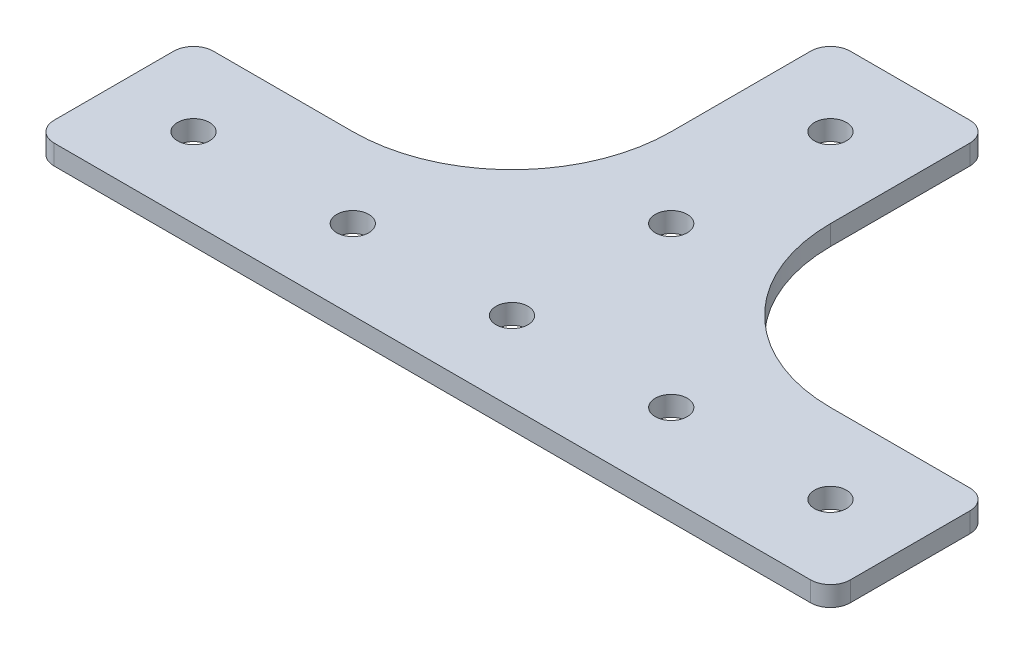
ISO-10303-21;
HEADER;
FILE_DESCRIPTION(('STEP AP214'),'2;1');
FILE_NAME('part.step','',(''),(''),'','','');
FILE_SCHEMA(('AUTOMOTIVE_DESIGN { 1 0 10303 214 1 1 1 1 }'));
ENDSEC;
DATA;
#1=APPLICATION_CONTEXT('core data for automotive mechanical design processes');
#2=APPLICATION_PROTOCOL_DEFINITION('international standard','automotive_design',2000,#1);
#3=PRODUCT_CONTEXT('',#1,'mechanical');
#4=PRODUCT('Part','Part','',(#3));
#5=PRODUCT_RELATED_PRODUCT_CATEGORY('part','',(#4));
#6=PRODUCT_DEFINITION_FORMATION('','',#4);
#7=PRODUCT_DEFINITION_CONTEXT('part definition',#1,'design');
#8=PRODUCT_DEFINITION('design','',#6,#7);
#9=PRODUCT_DEFINITION_SHAPE('','',#8);
#10=(LENGTH_UNIT() NAMED_UNIT(*) SI_UNIT(.MILLI.,.METRE.));
#11=(NAMED_UNIT(*) PLANE_ANGLE_UNIT() SI_UNIT($,.RADIAN.));
#12=(NAMED_UNIT(*) SI_UNIT($,.STERADIAN.) SOLID_ANGLE_UNIT());
#13=UNCERTAINTY_MEASURE_WITH_UNIT(LENGTH_MEASURE(1.E-05),#10,'distance_accuracy_value','');
#14=(GEOMETRIC_REPRESENTATION_CONTEXT(3) GLOBAL_UNCERTAINTY_ASSIGNED_CONTEXT((#13)) GLOBAL_UNIT_ASSIGNED_CONTEXT((#10,
#11,#12)) REPRESENTATION_CONTEXT('',''));
#15=CARTESIAN_POINT('',(0.,0.,0.));
#16=DIRECTION('',(0.,0.,1.));
#17=DIRECTION('',(1.,0.,0.));
#18=AXIS2_PLACEMENT_3D('',#15,#16,#17);
#19=CARTESIAN_POINT('',(38.1,3.175,-50.8));
#20=DIRECTION('',(0.,-1.,0.));
#21=DIRECTION('',(0.,0.,-1.));
#22=AXIS2_PLACEMENT_3D('',#19,#20,#21);
#23=CYLINDRICAL_SURFACE('',#22,25.4);
#24=CARTESIAN_POINT('',(38.1,0.,-50.8));
#25=DIRECTION('',(0.,-1.,0.));
#26=DIRECTION('',(0.,0.,-1.));
#27=AXIS2_PLACEMENT_3D('',#24,#25,#26);
#28=CIRCLE('',#27,25.4);
#29=CARTESIAN_POINT('',(38.1000000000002,0.,-25.4));
#30=VERTEX_POINT('',#29);
#31=CARTESIAN_POINT('',(12.7,0.,-50.8000000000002));
#32=VERTEX_POINT('',#31);
#33=EDGE_CURVE('E186',#30,#32,#28,.T.);
#34=ORIENTED_EDGE('',*,*,#33,.T.);
#35=DIRECTION('',(0.,-1.,0.));
#36=VECTOR('',#35,1.);
#37=CARTESIAN_POINT('',(12.7,3.175,-50.8000000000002));
#38=LINE('',#37,#36);
#39=CARTESIAN_POINT('',(12.7,3.175,-50.8000000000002));
#40=VERTEX_POINT('',#39);
#41=EDGE_CURVE('E11',#40,#32,#38,.T.);
#42=ORIENTED_EDGE('',*,*,#41,.F.);
#43=CARTESIAN_POINT('',(38.1,3.175,-50.8));
#44=DIRECTION('',(0.,-1.,0.));
#45=DIRECTION('',(0.,0.,-1.));
#46=AXIS2_PLACEMENT_3D('',#43,#44,#45);
#47=CIRCLE('',#46,25.4);
#48=CARTESIAN_POINT('',(38.1000000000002,3.175,-25.4));
#49=VERTEX_POINT('',#48);
#50=EDGE_CURVE('E233',#49,#40,#47,.T.);
#51=ORIENTED_EDGE('',*,*,#50,.F.);
#52=DIRECTION('',(0.,-1.,0.));
#53=VECTOR('',#52,1.);
#54=CARTESIAN_POINT('',(38.1000000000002,3.175,-25.4));
#55=LINE('',#54,#53);
#56=EDGE_CURVE('E182',#49,#30,#55,.T.);
#57=ORIENTED_EDGE('',*,*,#56,.T.);
#58=EDGE_LOOP('',(#34,#42,#51,#57));
#59=FACE_BOUND('',#58,.T.);
#60=ADVANCED_FACE('F36',(#59),#23,.F.);
#61=CARTESIAN_POINT('',(12.7,3.175,-50.8000000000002));
#62=DIRECTION('',(-1.,0.,0.));
#63=DIRECTION('',(0.,0.,1.));
#64=AXIS2_PLACEMENT_3D('',#61,#62,#63);
#65=PLANE('',#64);
#66=DIRECTION('',(0.,0.,-1.));
#67=VECTOR('',#66,1.);
#68=CARTESIAN_POINT('',(12.7,0.,-50.8000000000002));
#69=LINE('',#68,#67);
#70=CARTESIAN_POINT('',(12.7,0.,-73.025));
#71=VERTEX_POINT('',#70);
#72=EDGE_CURVE('E190',#32,#71,#69,.T.);
#73=ORIENTED_EDGE('',*,*,#72,.T.);
#74=DIRECTION('',(0.,-1.,0.));
#75=VECTOR('',#74,1.);
#76=CARTESIAN_POINT('',(12.7,3.175,-73.025));
#77=LINE('',#76,#75);
#78=CARTESIAN_POINT('',(12.7,3.175,-73.025));
#79=VERTEX_POINT('',#78);
#80=EDGE_CURVE('E45',#79,#71,#77,.T.);
#81=ORIENTED_EDGE('',*,*,#80,.F.);
#82=DIRECTION('',(0.,0.,-1.));
#83=VECTOR('',#82,1.);
#84=CARTESIAN_POINT('',(12.7,3.175,-50.8000000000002));
#85=LINE('',#84,#83);
#86=EDGE_CURVE('E120',#40,#79,#85,.T.);
#87=ORIENTED_EDGE('',*,*,#86,.F.);
#88=ORIENTED_EDGE('',*,*,#41,.T.);
#89=EDGE_LOOP('',(#73,#81,#87,#88));
#90=FACE_BOUND('',#89,.T.);
#91=ADVANCED_FACE('F367',(#90),#65,.F.);
#92=CARTESIAN_POINT('',(9.525,3.175,-73.025));
#93=DIRECTION('',(0.,-1.,0.));
#94=DIRECTION('',(0.,0.,-1.));
#95=AXIS2_PLACEMENT_3D('',#92,#93,#94);
#96=CYLINDRICAL_SURFACE('',#95,3.175);
#97=CARTESIAN_POINT('',(9.525,0.,-73.025));
#98=DIRECTION('',(0.,1.,0.));
#99=DIRECTION('',(0.,0.,1.));
#100=AXIS2_PLACEMENT_3D('',#97,#98,#99);
#101=CIRCLE('',#100,3.175);
#102=CARTESIAN_POINT('',(9.52499999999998,0.,-76.2));
#103=VERTEX_POINT('',#102);
#104=EDGE_CURVE('E194',#71,#103,#101,.T.);
#105=ORIENTED_EDGE('',*,*,#104,.T.);
#106=DIRECTION('',(0.,-1.,0.));
#107=VECTOR('',#106,1.);
#108=CARTESIAN_POINT('',(9.52499999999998,3.175,-76.2));
#109=LINE('',#108,#107);
#110=CARTESIAN_POINT('',(9.52499999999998,3.175,-76.2));
#111=VERTEX_POINT('',#110);
#112=EDGE_CURVE('E276',#111,#103,#109,.T.);
#113=ORIENTED_EDGE('',*,*,#112,.F.);
#114=CARTESIAN_POINT('',(9.525,3.175,-73.025));
#115=DIRECTION('',(0.,1.,0.));
#116=DIRECTION('',(0.,0.,1.));
#117=AXIS2_PLACEMENT_3D('',#114,#115,#116);
#118=CIRCLE('',#117,3.175);
#119=EDGE_CURVE('E287',#79,#111,#118,.T.);
#120=ORIENTED_EDGE('',*,*,#119,.F.);
#121=ORIENTED_EDGE('',*,*,#80,.T.);
#122=EDGE_LOOP('',(#105,#113,#120,#121));
#123=FACE_BOUND('',#122,.T.);
#124=ADVANCED_FACE('F285',(#123),#96,.T.);
#125=CARTESIAN_POINT('',(9.52499999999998,3.175,-76.2));
#126=DIRECTION('',(0.,0.,1.));
#127=DIRECTION('',(1.,0.,0.));
#128=AXIS2_PLACEMENT_3D('',#125,#126,#127);
#129=PLANE('',#128);
#130=DIRECTION('',(-1.,0.,0.));
#131=VECTOR('',#130,1.);
#132=CARTESIAN_POINT('',(9.52499999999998,0.,-76.2));
#133=LINE('',#132,#131);
#134=CARTESIAN_POINT('',(-9.52499999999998,0.,-76.2));
#135=VERTEX_POINT('',#134);
#136=EDGE_CURVE('E197',#103,#135,#133,.T.);
#137=ORIENTED_EDGE('',*,*,#136,.T.);
#138=DIRECTION('',(0.,-1.,0.));
#139=VECTOR('',#138,1.);
#140=CARTESIAN_POINT('',(-9.52499999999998,3.175,-76.2));
#141=LINE('',#140,#139);
#142=CARTESIAN_POINT('',(-9.52499999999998,3.175,-76.2));
#143=VERTEX_POINT('',#142);
#144=EDGE_CURVE('E272',#143,#135,#141,.T.);
#145=ORIENTED_EDGE('',*,*,#144,.F.);
#146=DIRECTION('',(-1.,0.,0.));
#147=VECTOR('',#146,1.);
#148=CARTESIAN_POINT('',(9.52499999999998,3.175,-76.2));
#149=LINE('',#148,#147);
#150=EDGE_CURVE('E306',#111,#143,#149,.T.);
#151=ORIENTED_EDGE('',*,*,#150,.F.);
#152=ORIENTED_EDGE('',*,*,#112,.T.);
#153=EDGE_LOOP('',(#137,#145,#151,#152));
#154=FACE_BOUND('',#153,.T.);
#155=ADVANCED_FACE('F296',(#154),#129,.F.);
#156=CARTESIAN_POINT('',(-9.525,3.175,-73.025));
#157=DIRECTION('',(0.,-1.,0.));
#158=DIRECTION('',(0.,0.,-1.));
#159=AXIS2_PLACEMENT_3D('',#156,#157,#158);
#160=CYLINDRICAL_SURFACE('',#159,3.175);
#161=CARTESIAN_POINT('',(-9.525,0.,-73.025));
#162=DIRECTION('',(0.,1.,0.));
#163=DIRECTION('',(0.,0.,1.));
#164=AXIS2_PLACEMENT_3D('',#161,#162,#163);
#165=CIRCLE('',#164,3.175);
#166=CARTESIAN_POINT('',(-12.7,0.,-73.025));
#167=VERTEX_POINT('',#166);
#168=EDGE_CURVE('E200',#135,#167,#165,.T.);
#169=ORIENTED_EDGE('',*,*,#168,.T.);
#170=DIRECTION('',(0.,-1.,0.));
#171=VECTOR('',#170,1.);
#172=CARTESIAN_POINT('',(-12.7,3.175,-73.025));
#173=LINE('',#172,#171);
#174=CARTESIAN_POINT('',(-12.7,3.175,-73.025));
#175=VERTEX_POINT('',#174);
#176=EDGE_CURVE('E268',#175,#167,#173,.T.);
#177=ORIENTED_EDGE('',*,*,#176,.F.);
#178=CARTESIAN_POINT('',(-9.525,3.175,-73.025));
#179=DIRECTION('',(0.,1.,0.));
#180=DIRECTION('',(0.,0.,1.));
#181=AXIS2_PLACEMENT_3D('',#178,#179,#180);
#182=CIRCLE('',#181,3.175);
#183=EDGE_CURVE('E302',#143,#175,#182,.T.);
#184=ORIENTED_EDGE('',*,*,#183,.F.);
#185=ORIENTED_EDGE('',*,*,#144,.T.);
#186=EDGE_LOOP('',(#169,#177,#184,#185));
#187=FACE_BOUND('',#186,.T.);
#188=ADVANCED_FACE('F300',(#187),#160,.T.);
#189=CARTESIAN_POINT('',(-12.7,3.175,-73.025));
#190=DIRECTION('',(1.,0.,0.));
#191=DIRECTION('',(0.,0.,-1.));
#192=AXIS2_PLACEMENT_3D('',#189,#190,#191);
#193=PLANE('',#192);
#194=DIRECTION('',(0.,0.,1.));
#195=VECTOR('',#194,1.);
#196=CARTESIAN_POINT('',(-12.7,0.,-73.025));
#197=LINE('',#196,#195);
#198=CARTESIAN_POINT('',(-12.7,0.,-50.8000000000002));
#199=VERTEX_POINT('',#198);
#200=EDGE_CURVE('E203',#167,#199,#197,.T.);
#201=ORIENTED_EDGE('',*,*,#200,.T.);
#202=DIRECTION('',(0.,-1.,0.));
#203=VECTOR('',#202,1.);
#204=CARTESIAN_POINT('',(-12.7,3.175,-50.8000000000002));
#205=LINE('',#204,#203);
#206=CARTESIAN_POINT('',(-12.7,3.175,-50.8000000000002));
#207=VERTEX_POINT('',#206);
#208=EDGE_CURVE('E264',#207,#199,#205,.T.);
#209=ORIENTED_EDGE('',*,*,#208,.F.);
#210=DIRECTION('',(0.,0.,1.));
#211=VECTOR('',#210,1.);
#212=CARTESIAN_POINT('',(-12.7,3.175,-73.025));
#213=LINE('',#212,#211);
#214=EDGE_CURVE('E305',#175,#207,#213,.T.);
#215=ORIENTED_EDGE('',*,*,#214,.F.);
#216=ORIENTED_EDGE('',*,*,#176,.T.);
#217=EDGE_LOOP('',(#201,#209,#215,#216));
#218=FACE_BOUND('',#217,.T.);
#219=ADVANCED_FACE('F380',(#218),#193,.F.);
#220=CARTESIAN_POINT('',(-38.1,3.175,-50.8));
#221=DIRECTION('',(0.,-1.,0.));
#222=DIRECTION('',(0.,0.,-1.));
#223=AXIS2_PLACEMENT_3D('',#220,#221,#222);
#224=CYLINDRICAL_SURFACE('',#223,25.4);
#225=CARTESIAN_POINT('',(-38.1,0.,-50.8));
#226=DIRECTION('',(0.,-1.,0.));
#227=DIRECTION('',(0.,0.,-1.));
#228=AXIS2_PLACEMENT_3D('',#225,#226,#227);
#229=CIRCLE('',#228,25.4);
#230=CARTESIAN_POINT('',(-38.1000000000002,0.,-25.4));
#231=VERTEX_POINT('',#230);
#232=EDGE_CURVE('E206',#199,#231,#229,.T.);
#233=ORIENTED_EDGE('',*,*,#232,.T.);
#234=DIRECTION('',(0.,-1.,0.));
#235=VECTOR('',#234,1.);
#236=CARTESIAN_POINT('',(-38.1000000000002,3.175,-25.4));
#237=LINE('',#236,#235);
#238=CARTESIAN_POINT('',(-38.1000000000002,3.175,-25.4));
#239=VERTEX_POINT('',#238);
#240=EDGE_CURVE('E260',#239,#231,#237,.T.);
#241=ORIENTED_EDGE('',*,*,#240,.F.);
#242=CARTESIAN_POINT('',(-38.1,3.175,-50.8));
#243=DIRECTION('',(0.,-1.,0.));
#244=DIRECTION('',(0.,0.,-1.));
#245=AXIS2_PLACEMENT_3D('',#242,#243,#244);
#246=CIRCLE('',#245,25.4);
#247=EDGE_CURVE('E311',#207,#239,#246,.T.);
#248=ORIENTED_EDGE('',*,*,#247,.F.);
#249=ORIENTED_EDGE('',*,*,#208,.T.);
#250=EDGE_LOOP('',(#233,#241,#248,#249));
#251=FACE_BOUND('',#250,.T.);
#252=ADVANCED_FACE('F383',(#251),#224,.F.);
#253=CARTESIAN_POINT('',(-38.1000000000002,3.175,-25.4));
#254=DIRECTION('',(0.,0.,1.));
#255=DIRECTION('',(1.,0.,0.));
#256=AXIS2_PLACEMENT_3D('',#253,#254,#255);
#257=PLANE('',#256);
#258=DIRECTION('',(-1.,0.,0.));
#259=VECTOR('',#258,1.);
#260=CARTESIAN_POINT('',(-38.1000000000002,0.,-25.4));
#261=LINE('',#260,#259);
#262=CARTESIAN_POINT('',(-60.325,0.,-25.4));
#263=VERTEX_POINT('',#262);
#264=EDGE_CURVE('E209',#231,#263,#261,.T.);
#265=ORIENTED_EDGE('',*,*,#264,.T.);
#266=DIRECTION('',(0.,-1.,0.));
#267=VECTOR('',#266,1.);
#268=CARTESIAN_POINT('',(-60.325,3.175,-25.4));
#269=LINE('',#268,#267);
#270=CARTESIAN_POINT('',(-60.325,3.175,-25.4));
#271=VERTEX_POINT('',#270);
#272=EDGE_CURVE('E256',#271,#263,#269,.T.);
#273=ORIENTED_EDGE('',*,*,#272,.F.);
#274=DIRECTION('',(-1.,0.,0.));
#275=VECTOR('',#274,1.);
#276=CARTESIAN_POINT('',(-38.1000000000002,3.175,-25.4));
#277=LINE('',#276,#275);
#278=EDGE_CURVE('E318',#239,#271,#277,.T.);
#279=ORIENTED_EDGE('',*,*,#278,.F.);
#280=ORIENTED_EDGE('',*,*,#240,.T.);
#281=EDGE_LOOP('',(#265,#273,#279,#280));
#282=FACE_BOUND('',#281,.T.);
#283=ADVANCED_FACE('F387',(#282),#257,.F.);
#284=CARTESIAN_POINT('',(-60.325,3.175,-22.225));
#285=DIRECTION('',(0.,-1.,0.));
#286=DIRECTION('',(0.,0.,-1.));
#287=AXIS2_PLACEMENT_3D('',#284,#285,#286);
#288=CYLINDRICAL_SURFACE('',#287,3.175);
#289=CARTESIAN_POINT('',(-60.325,0.,-22.225));
#290=DIRECTION('',(0.,1.,0.));
#291=DIRECTION('',(0.,0.,1.));
#292=AXIS2_PLACEMENT_3D('',#289,#290,#291);
#293=CIRCLE('',#292,3.175);
#294=CARTESIAN_POINT('',(-63.5,0.,-22.225));
#295=VERTEX_POINT('',#294);
#296=EDGE_CURVE('E212',#263,#295,#293,.T.);
#297=ORIENTED_EDGE('',*,*,#296,.T.);
#298=DIRECTION('',(0.,-1.,0.));
#299=VECTOR('',#298,1.);
#300=CARTESIAN_POINT('',(-63.5,3.175,-22.225));
#301=LINE('',#300,#299);
#302=CARTESIAN_POINT('',(-63.5,3.175,-22.225));
#303=VERTEX_POINT('',#302);
#304=EDGE_CURVE('E252',#303,#295,#301,.T.);
#305=ORIENTED_EDGE('',*,*,#304,.F.);
#306=CARTESIAN_POINT('',(-60.325,3.175,-22.225));
#307=DIRECTION('',(0.,1.,0.));
#308=DIRECTION('',(0.,0.,1.));
#309=AXIS2_PLACEMENT_3D('',#306,#307,#308);
#310=CIRCLE('',#309,3.175);
#311=EDGE_CURVE('E321',#271,#303,#310,.T.);
#312=ORIENTED_EDGE('',*,*,#311,.F.);
#313=ORIENTED_EDGE('',*,*,#272,.T.);
#314=EDGE_LOOP('',(#297,#305,#312,#313));
#315=FACE_BOUND('',#314,.T.);
#316=ADVANCED_FACE('F391',(#315),#288,.T.);
#317=CARTESIAN_POINT('',(-63.5,3.175,-22.225));
#318=DIRECTION('',(1.,0.,0.));
#319=DIRECTION('',(0.,0.,-1.));
#320=AXIS2_PLACEMENT_3D('',#317,#318,#319);
#321=PLANE('',#320);
#322=DIRECTION('',(0.,0.,1.));
#323=VECTOR('',#322,1.);
#324=CARTESIAN_POINT('',(-63.5,0.,-22.225));
#325=LINE('',#324,#323);
#326=CARTESIAN_POINT('',(-63.5,0.,-3.17500000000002));
#327=VERTEX_POINT('',#326);
#328=EDGE_CURVE('E215',#295,#327,#325,.T.);
#329=ORIENTED_EDGE('',*,*,#328,.T.);
#330=DIRECTION('',(0.,-1.,0.));
#331=VECTOR('',#330,1.);
#332=CARTESIAN_POINT('',(-63.5,3.175,-3.17500000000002));
#333=LINE('',#332,#331);
#334=CARTESIAN_POINT('',(-63.5,3.175,-3.17500000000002));
#335=VERTEX_POINT('',#334);
#336=EDGE_CURVE('E248',#335,#327,#333,.T.);
#337=ORIENTED_EDGE('',*,*,#336,.F.);
#338=DIRECTION('',(0.,0.,1.));
#339=VECTOR('',#338,1.);
#340=CARTESIAN_POINT('',(-63.5,3.175,-22.225));
#341=LINE('',#340,#339);
#342=EDGE_CURVE('E324',#303,#335,#341,.T.);
#343=ORIENTED_EDGE('',*,*,#342,.F.);
#344=ORIENTED_EDGE('',*,*,#304,.T.);
#345=EDGE_LOOP('',(#329,#337,#343,#344));
#346=FACE_BOUND('',#345,.T.);
#347=ADVANCED_FACE('F395',(#346),#321,.F.);
#348=CARTESIAN_POINT('',(-60.325,3.175,-3.175));
#349=DIRECTION('',(0.,-1.,0.));
#350=DIRECTION('',(0.,0.,-1.));
#351=AXIS2_PLACEMENT_3D('',#348,#349,#350);
#352=CYLINDRICAL_SURFACE('',#351,3.175);
#353=CARTESIAN_POINT('',(-60.325,0.,-3.175));
#354=DIRECTION('',(0.,1.,0.));
#355=DIRECTION('',(0.,0.,-1.));
#356=AXIS2_PLACEMENT_3D('',#353,#354,#355);
#357=CIRCLE('',#356,3.175);
#358=CARTESIAN_POINT('',(-60.325,0.,0.));
#359=VERTEX_POINT('',#358);
#360=EDGE_CURVE('E218',#327,#359,#357,.T.);
#361=ORIENTED_EDGE('',*,*,#360,.T.);
#362=DIRECTION('',(0.,-1.,0.));
#363=VECTOR('',#362,1.);
#364=CARTESIAN_POINT('',(-60.325,3.175,0.));
#365=LINE('',#364,#363);
#366=CARTESIAN_POINT('',(-60.325,3.175,0.));
#367=VERTEX_POINT('',#366);
#368=EDGE_CURVE('E244',#367,#359,#365,.T.);
#369=ORIENTED_EDGE('',*,*,#368,.F.);
#370=CARTESIAN_POINT('',(-60.325,3.175,-3.175));
#371=DIRECTION('',(0.,1.,0.));
#372=DIRECTION('',(0.,0.,-1.));
#373=AXIS2_PLACEMENT_3D('',#370,#371,#372);
#374=CIRCLE('',#373,3.175);
#375=EDGE_CURVE('E327',#335,#367,#374,.T.);
#376=ORIENTED_EDGE('',*,*,#375,.F.);
#377=ORIENTED_EDGE('',*,*,#336,.T.);
#378=EDGE_LOOP('',(#361,#369,#376,#377));
#379=FACE_BOUND('',#378,.T.);
#380=ADVANCED_FACE('F399',(#379),#352,.T.);
#381=CARTESIAN_POINT('',(-60.325,3.175,0.));
#382=DIRECTION('',(0.,0.,-1.));
#383=DIRECTION('',(-1.,0.,0.));
#384=AXIS2_PLACEMENT_3D('',#381,#382,#383);
#385=PLANE('',#384);
#386=DIRECTION('',(1.,0.,0.));
#387=VECTOR('',#386,1.);
#388=CARTESIAN_POINT('',(-60.325,0.,0.));
#389=LINE('',#388,#387);
#390=CARTESIAN_POINT('',(60.325,0.,0.));
#391=VERTEX_POINT('',#390);
#392=EDGE_CURVE('E221',#359,#391,#389,.T.);
#393=ORIENTED_EDGE('',*,*,#392,.T.);
#394=DIRECTION('',(0.,-1.,0.));
#395=VECTOR('',#394,1.);
#396=CARTESIAN_POINT('',(60.325,3.175,0.));
#397=LINE('',#396,#395);
#398=CARTESIAN_POINT('',(60.325,3.175,0.));
#399=VERTEX_POINT('',#398);
#400=EDGE_CURVE('E240',#399,#391,#397,.T.);
#401=ORIENTED_EDGE('',*,*,#400,.F.);
#402=DIRECTION('',(1.,0.,0.));
#403=VECTOR('',#402,1.);
#404=CARTESIAN_POINT('',(-60.325,3.175,0.));
#405=LINE('',#404,#403);
#406=EDGE_CURVE('E330',#367,#399,#405,.T.);
#407=ORIENTED_EDGE('',*,*,#406,.F.);
#408=ORIENTED_EDGE('',*,*,#368,.T.);
#409=EDGE_LOOP('',(#393,#401,#407,#408));
#410=FACE_BOUND('',#409,.T.);
#411=ADVANCED_FACE('F347',(#410),#385,.F.);
#412=CARTESIAN_POINT('',(60.325,3.175,-3.175));
#413=DIRECTION('',(0.,-1.,0.));
#414=DIRECTION('',(0.,0.,-1.));
#415=AXIS2_PLACEMENT_3D('',#412,#413,#414);
#416=CYLINDRICAL_SURFACE('',#415,3.175);
#417=CARTESIAN_POINT('',(60.325,0.,-3.175));
#418=DIRECTION('',(0.,1.,0.));
#419=DIRECTION('',(0.,0.,1.));
#420=AXIS2_PLACEMENT_3D('',#417,#418,#419);
#421=CIRCLE('',#420,3.175);
#422=CARTESIAN_POINT('',(63.5,0.,-3.17500000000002));
#423=VERTEX_POINT('',#422);
#424=EDGE_CURVE('E224',#391,#423,#421,.T.);
#425=ORIENTED_EDGE('',*,*,#424,.T.);
#426=DIRECTION('',(0.,-1.,0.));
#427=VECTOR('',#426,1.);
#428=CARTESIAN_POINT('',(63.5,3.175,-3.17500000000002));
#429=LINE('',#428,#427);
#430=CARTESIAN_POINT('',(63.5,3.175,-3.17500000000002));
#431=VERTEX_POINT('',#430);
#432=EDGE_CURVE('E174',#431,#423,#429,.T.);
#433=ORIENTED_EDGE('',*,*,#432,.F.);
#434=CARTESIAN_POINT('',(60.325,3.175,-3.175));
#435=DIRECTION('',(0.,1.,0.));
#436=DIRECTION('',(0.,0.,1.));
#437=AXIS2_PLACEMENT_3D('',#434,#435,#436);
#438=CIRCLE('',#437,3.175);
#439=EDGE_CURVE('E163',#399,#431,#438,.T.);
#440=ORIENTED_EDGE('',*,*,#439,.F.);
#441=ORIENTED_EDGE('',*,*,#400,.T.);
#442=EDGE_LOOP('',(#425,#433,#440,#441));
#443=FACE_BOUND('',#442,.T.);
#444=ADVANCED_FACE('F351',(#443),#416,.T.);
#445=CARTESIAN_POINT('',(63.5,3.175,-3.17500000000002));
#446=DIRECTION('',(-1.,0.,0.));
#447=DIRECTION('',(0.,0.,1.));
#448=AXIS2_PLACEMENT_3D('',#445,#446,#447);
#449=PLANE('',#448);
#450=DIRECTION('',(0.,0.,-1.));
#451=VECTOR('',#450,1.);
#452=CARTESIAN_POINT('',(63.5,0.,-3.17500000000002));
#453=LINE('',#452,#451);
#454=CARTESIAN_POINT('',(63.5,0.,-22.225));
#455=VERTEX_POINT('',#454);
#456=EDGE_CURVE('E172',#423,#455,#453,.T.);
#457=ORIENTED_EDGE('',*,*,#456,.T.);
#458=DIRECTION('',(0.,-1.,0.));
#459=VECTOR('',#458,1.);
#460=CARTESIAN_POINT('',(63.5,3.175,-22.225));
#461=LINE('',#460,#459);
#462=CARTESIAN_POINT('',(63.5,3.175,-22.225));
#463=VERTEX_POINT('',#462);
#464=EDGE_CURVE('E169',#463,#455,#461,.T.);
#465=ORIENTED_EDGE('',*,*,#464,.F.);
#466=DIRECTION('',(0.,0.,-1.));
#467=VECTOR('',#466,1.);
#468=CARTESIAN_POINT('',(63.5,3.175,-3.17500000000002));
#469=LINE('',#468,#467);
#470=EDGE_CURVE('E157',#431,#463,#469,.T.);
#471=ORIENTED_EDGE('',*,*,#470,.F.);
#472=ORIENTED_EDGE('',*,*,#432,.T.);
#473=EDGE_LOOP('',(#457,#465,#471,#472));
#474=FACE_BOUND('',#473,.T.);
#475=ADVANCED_FACE('F170',(#474),#449,.F.);
#476=CARTESIAN_POINT('',(60.325,3.175,-22.225));
#477=DIRECTION('',(0.,-1.,0.));
#478=DIRECTION('',(0.,0.,-1.));
#479=AXIS2_PLACEMENT_3D('',#476,#477,#478);
#480=CYLINDRICAL_SURFACE('',#479,3.175);
#481=CARTESIAN_POINT('',(60.325,0.,-22.225));
#482=DIRECTION('',(0.,1.,0.));
#483=DIRECTION('',(0.,0.,1.));
#484=AXIS2_PLACEMENT_3D('',#481,#482,#483);
#485=CIRCLE('',#484,3.175);
#486=CARTESIAN_POINT('',(60.325,0.,-25.4));
#487=VERTEX_POINT('',#486);
#488=EDGE_CURVE('E106',#455,#487,#485,.T.);
#489=ORIENTED_EDGE('',*,*,#488,.T.);
#490=DIRECTION('',(0.,-1.,0.));
#491=VECTOR('',#490,1.);
#492=CARTESIAN_POINT('',(60.325,3.175,-25.4));
#493=LINE('',#492,#491);
#494=CARTESIAN_POINT('',(60.325,3.175,-25.4));
#495=VERTEX_POINT('',#494);
#496=EDGE_CURVE('E175',#495,#487,#493,.T.);
#497=ORIENTED_EDGE('',*,*,#496,.F.);
#498=CARTESIAN_POINT('',(60.325,3.175,-22.225));
#499=DIRECTION('',(0.,1.,0.));
#500=DIRECTION('',(0.,0.,1.));
#501=AXIS2_PLACEMENT_3D('',#498,#499,#500);
#502=CIRCLE('',#501,3.175);
#503=EDGE_CURVE('E161',#463,#495,#502,.T.);
#504=ORIENTED_EDGE('',*,*,#503,.F.);
#505=ORIENTED_EDGE('',*,*,#464,.T.);
#506=EDGE_LOOP('',(#489,#497,#504,#505));
#507=FACE_BOUND('',#506,.T.);
#508=ADVANCED_FACE('F177',(#507),#480,.T.);
#509=CARTESIAN_POINT('',(60.325,3.175,-25.4));
#510=DIRECTION('',(0.,0.,1.));
#511=DIRECTION('',(1.,0.,0.));
#512=AXIS2_PLACEMENT_3D('',#509,#510,#511);
#513=PLANE('',#512);
#514=DIRECTION('',(-1.,0.,0.));
#515=VECTOR('',#514,1.);
#516=CARTESIAN_POINT('',(60.325,0.,-25.4));
#517=LINE('',#516,#515);
#518=EDGE_CURVE('E112',#487,#30,#517,.T.);
#519=ORIENTED_EDGE('',*,*,#518,.T.);
#520=ORIENTED_EDGE('',*,*,#56,.F.);
#521=DIRECTION('',(-1.,0.,0.));
#522=VECTOR('',#521,1.);
#523=CARTESIAN_POINT('',(60.325,3.175,-25.4));
#524=LINE('',#523,#522);
#525=EDGE_CURVE('E53',#495,#49,#524,.T.);
#526=ORIENTED_EDGE('',*,*,#525,.F.);
#527=ORIENTED_EDGE('',*,*,#496,.T.);
#528=EDGE_LOOP('',(#519,#520,#526,#527));
#529=FACE_BOUND('',#528,.T.);
#530=ADVANCED_FACE('F355',(#529),#513,.F.);
#531=CARTESIAN_POINT('',(38.1,3.175,-50.8));
#532=DIRECTION('',(0.,-1.,0.));
#533=DIRECTION('',(0.,0.,-1.));
#534=AXIS2_PLACEMENT_3D('',#531,#532,#533);
#535=PLANE('',#534);
#536=CARTESIAN_POINT('',(-50.8,3.175,-12.7));
#537=DIRECTION('',(0.,1.,0.));
#538=DIRECTION('',(0.,0.,1.));
#539=AXIS2_PLACEMENT_3D('',#536,#537,#538);
#540=CIRCLE('',#539,2.5527);
#541=CARTESIAN_POINT('',(-50.8,3.175,-10.1473));
#542=VERTEX_POINT('',#541);
#543=EDGE_CURVE('E639',#542,#542,#540,.T.);
#544=ORIENTED_EDGE('',*,*,#543,.F.);
#545=EDGE_LOOP('',(#544));
#546=FACE_BOUND('',#545,.T.);
#547=CARTESIAN_POINT('',(-25.4,3.175,-12.7));
#548=DIRECTION('',(0.,1.,0.));
#549=DIRECTION('',(0.,0.,1.));
#550=AXIS2_PLACEMENT_3D('',#547,#548,#549);
#551=CIRCLE('',#550,2.55269999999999);
#552=CARTESIAN_POINT('',(-25.4,3.175,-10.1473));
#553=VERTEX_POINT('',#552);
#554=EDGE_CURVE('E644',#553,#553,#551,.T.);
#555=ORIENTED_EDGE('',*,*,#554,.F.);
#556=EDGE_LOOP('',(#555));
#557=FACE_BOUND('',#556,.T.);
#558=CARTESIAN_POINT('',(0.,3.175,-12.7));
#559=DIRECTION('',(0.,1.,0.));
#560=DIRECTION('',(0.,0.,1.));
#561=AXIS2_PLACEMENT_3D('',#558,#559,#560);
#562=CIRCLE('',#561,2.5527);
#563=CARTESIAN_POINT('',(0.,3.175,-10.1473));
#564=VERTEX_POINT('',#563);
#565=EDGE_CURVE('E654',#564,#564,#562,.T.);
#566=ORIENTED_EDGE('',*,*,#565,.F.);
#567=EDGE_LOOP('',(#566));
#568=FACE_BOUND('',#567,.T.);
#569=CARTESIAN_POINT('',(25.4,3.175,-12.7));
#570=DIRECTION('',(0.,1.,0.));
#571=DIRECTION('',(0.,0.,1.));
#572=AXIS2_PLACEMENT_3D('',#569,#570,#571);
#573=CIRCLE('',#572,2.55269999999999);
#574=CARTESIAN_POINT('',(25.4,3.175,-10.1473));
#575=VERTEX_POINT('',#574);
#576=EDGE_CURVE('E662',#575,#575,#573,.T.);
#577=ORIENTED_EDGE('',*,*,#576,.F.);
#578=EDGE_LOOP('',(#577));
#579=FACE_BOUND('',#578,.T.);
#580=CARTESIAN_POINT('',(50.8,3.175,-12.7));
#581=DIRECTION('',(0.,1.,0.));
#582=DIRECTION('',(0.,0.,1.));
#583=AXIS2_PLACEMENT_3D('',#580,#581,#582);
#584=CIRCLE('',#583,2.5527);
#585=CARTESIAN_POINT('',(50.8,3.175,-10.1473));
#586=VERTEX_POINT('',#585);
#587=EDGE_CURVE('E670',#586,#586,#584,.T.);
#588=ORIENTED_EDGE('',*,*,#587,.F.);
#589=EDGE_LOOP('',(#588));
#590=FACE_BOUND('',#589,.T.);
#591=CARTESIAN_POINT('',(0.,3.175,-38.1));
#592=DIRECTION('',(0.,1.,0.));
#593=DIRECTION('',(0.,0.,1.));
#594=AXIS2_PLACEMENT_3D('',#591,#592,#593);
#595=CIRCLE('',#594,2.5527);
#596=CARTESIAN_POINT('',(0.,3.175,-35.5473));
#597=VERTEX_POINT('',#596);
#598=EDGE_CURVE('E678',#597,#597,#595,.T.);
#599=ORIENTED_EDGE('',*,*,#598,.F.);
#600=EDGE_LOOP('',(#599));
#601=FACE_BOUND('',#600,.T.);
#602=CARTESIAN_POINT('',(0.,3.175,-63.5));
#603=DIRECTION('',(0.,1.,0.));
#604=DIRECTION('',(0.,0.,1.));
#605=AXIS2_PLACEMENT_3D('',#602,#603,#604);
#606=CIRCLE('',#605,2.5527);
#607=CARTESIAN_POINT('',(0.,3.175,-60.9473));
#608=VERTEX_POINT('',#607);
#609=EDGE_CURVE('E686',#608,#608,#606,.T.);
#610=ORIENTED_EDGE('',*,*,#609,.F.);
#611=EDGE_LOOP('',(#610));
#612=FACE_BOUND('',#611,.T.);
#613=ORIENTED_EDGE('',*,*,#50,.T.);
#614=ORIENTED_EDGE('',*,*,#86,.T.);
#615=ORIENTED_EDGE('',*,*,#119,.T.);
#616=ORIENTED_EDGE('',*,*,#150,.T.);
#617=ORIENTED_EDGE('',*,*,#183,.T.);
#618=ORIENTED_EDGE('',*,*,#214,.T.);
#619=ORIENTED_EDGE('',*,*,#247,.T.);
#620=ORIENTED_EDGE('',*,*,#278,.T.);
#621=ORIENTED_EDGE('',*,*,#311,.T.);
#622=ORIENTED_EDGE('',*,*,#342,.T.);
#623=ORIENTED_EDGE('',*,*,#375,.T.);
#624=ORIENTED_EDGE('',*,*,#406,.T.);
#625=ORIENTED_EDGE('',*,*,#439,.T.);
#626=ORIENTED_EDGE('',*,*,#470,.T.);
#627=ORIENTED_EDGE('',*,*,#503,.T.);
#628=ORIENTED_EDGE('',*,*,#525,.T.);
#629=EDGE_LOOP('',(#613,#614,#615,#616,#617,#618,#619,#620,#621,#622,#623,#624,#625,#626,#627,#628));
#630=FACE_BOUND('',#629,.T.);
#631=ADVANCED_FACE('F159',(#546,#557,#568,#579,#590,#601,#612,#630),#535,.F.);
#632=CARTESIAN_POINT('',(38.1,0.,-50.8));
#633=DIRECTION('',(0.,-1.,0.));
#634=DIRECTION('',(0.,0.,-1.));
#635=AXIS2_PLACEMENT_3D('',#632,#633,#634);
#636=PLANE('',#635);
#637=CARTESIAN_POINT('',(-50.8,0.,-12.7));
#638=DIRECTION('',(0.,1.,0.));
#639=DIRECTION('',(0.,0.,1.));
#640=AXIS2_PLACEMENT_3D('',#637,#638,#639);
#641=CIRCLE('',#640,2.5527);
#642=CARTESIAN_POINT('',(-50.8,0.,-10.1473));
#643=VERTEX_POINT('',#642);
#644=EDGE_CURVE('E636',#643,#643,#641,.T.);
#645=ORIENTED_EDGE('',*,*,#644,.T.);
#646=EDGE_LOOP('',(#645));
#647=FACE_BOUND('',#646,.T.);
#648=CARTESIAN_POINT('',(-25.4,0.,-12.7));
#649=DIRECTION('',(0.,1.,0.));
#650=DIRECTION('',(0.,0.,1.));
#651=AXIS2_PLACEMENT_3D('',#648,#649,#650);
#652=CIRCLE('',#651,2.55269999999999);
#653=CARTESIAN_POINT('',(-25.4,0.,-10.1473));
#654=VERTEX_POINT('',#653);
#655=EDGE_CURVE('E650',#654,#654,#652,.T.);
#656=ORIENTED_EDGE('',*,*,#655,.T.);
#657=EDGE_LOOP('',(#656));
#658=FACE_BOUND('',#657,.T.);
#659=CARTESIAN_POINT('',(0.,0.,-12.7));
#660=DIRECTION('',(0.,1.,0.));
#661=DIRECTION('',(0.,0.,1.));
#662=AXIS2_PLACEMENT_3D('',#659,#660,#661);
#663=CIRCLE('',#662,2.5527);
#664=CARTESIAN_POINT('',(0.,0.,-10.1473));
#665=VERTEX_POINT('',#664);
#666=EDGE_CURVE('E658',#665,#665,#663,.T.);
#667=ORIENTED_EDGE('',*,*,#666,.T.);
#668=EDGE_LOOP('',(#667));
#669=FACE_BOUND('',#668,.T.);
#670=CARTESIAN_POINT('',(25.4,0.,-12.7));
#671=DIRECTION('',(0.,1.,0.));
#672=DIRECTION('',(0.,0.,1.));
#673=AXIS2_PLACEMENT_3D('',#670,#671,#672);
#674=CIRCLE('',#673,2.55269999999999);
#675=CARTESIAN_POINT('',(25.4,0.,-10.1473));
#676=VERTEX_POINT('',#675);
#677=EDGE_CURVE('E666',#676,#676,#674,.T.);
#678=ORIENTED_EDGE('',*,*,#677,.T.);
#679=EDGE_LOOP('',(#678));
#680=FACE_BOUND('',#679,.T.);
#681=CARTESIAN_POINT('',(50.8,0.,-12.7));
#682=DIRECTION('',(0.,1.,0.));
#683=DIRECTION('',(0.,0.,1.));
#684=AXIS2_PLACEMENT_3D('',#681,#682,#683);
#685=CIRCLE('',#684,2.5527);
#686=CARTESIAN_POINT('',(50.8,0.,-10.1473));
#687=VERTEX_POINT('',#686);
#688=EDGE_CURVE('E674',#687,#687,#685,.T.);
#689=ORIENTED_EDGE('',*,*,#688,.T.);
#690=EDGE_LOOP('',(#689));
#691=FACE_BOUND('',#690,.T.);
#692=CARTESIAN_POINT('',(0.,0.,-38.1));
#693=DIRECTION('',(0.,1.,0.));
#694=DIRECTION('',(0.,0.,1.));
#695=AXIS2_PLACEMENT_3D('',#692,#693,#694);
#696=CIRCLE('',#695,2.5527);
#697=CARTESIAN_POINT('',(0.,0.,-35.5473));
#698=VERTEX_POINT('',#697);
#699=EDGE_CURVE('E682',#698,#698,#696,.T.);
#700=ORIENTED_EDGE('',*,*,#699,.T.);
#701=EDGE_LOOP('',(#700));
#702=FACE_BOUND('',#701,.T.);
#703=CARTESIAN_POINT('',(0.,0.,-63.5));
#704=DIRECTION('',(0.,1.,0.));
#705=DIRECTION('',(0.,0.,1.));
#706=AXIS2_PLACEMENT_3D('',#703,#704,#705);
#707=CIRCLE('',#706,2.5527);
#708=CARTESIAN_POINT('',(0.,0.,-60.9473));
#709=VERTEX_POINT('',#708);
#710=EDGE_CURVE('E191',#709,#709,#707,.T.);
#711=ORIENTED_EDGE('',*,*,#710,.T.);
#712=EDGE_LOOP('',(#711));
#713=FACE_BOUND('',#712,.T.);
#714=ORIENTED_EDGE('',*,*,#33,.F.);
#715=ORIENTED_EDGE('',*,*,#518,.F.);
#716=ORIENTED_EDGE('',*,*,#488,.F.);
#717=ORIENTED_EDGE('',*,*,#456,.F.);
#718=ORIENTED_EDGE('',*,*,#424,.F.);
#719=ORIENTED_EDGE('',*,*,#392,.F.);
#720=ORIENTED_EDGE('',*,*,#360,.F.);
#721=ORIENTED_EDGE('',*,*,#328,.F.);
#722=ORIENTED_EDGE('',*,*,#296,.F.);
#723=ORIENTED_EDGE('',*,*,#264,.F.);
#724=ORIENTED_EDGE('',*,*,#232,.F.);
#725=ORIENTED_EDGE('',*,*,#200,.F.);
#726=ORIENTED_EDGE('',*,*,#168,.F.);
#727=ORIENTED_EDGE('',*,*,#136,.F.);
#728=ORIENTED_EDGE('',*,*,#104,.F.);
#729=ORIENTED_EDGE('',*,*,#72,.F.);
#730=EDGE_LOOP('',(#714,#715,#716,#717,#718,#719,#720,#721,#722,#723,#724,#725,#726,#727,#728,#729));
#731=FACE_BOUND('',#730,.T.);
#732=ADVANCED_FACE('F291',(#647,#658,#669,#680,#691,#702,#713,#731),#636,.T.);
#733=CARTESIAN_POINT('',(0.,3.175,-63.5));
#734=DIRECTION('',(0.,1.,0.));
#735=DIRECTION('',(0.,0.,1.));
#736=AXIS2_PLACEMENT_3D('',#733,#734,#735);
#737=CYLINDRICAL_SURFACE('',#736,2.5527);
#738=ORIENTED_EDGE('',*,*,#710,.F.);
#739=EDGE_LOOP('',(#738));
#740=FACE_BOUND('',#739,.T.);
#741=ORIENTED_EDGE('',*,*,#609,.T.);
#742=EDGE_LOOP('',(#741));
#743=FACE_BOUND('',#742,.T.);
#744=ADVANCED_FACE('F436',(#740,#743),#737,.F.);
#745=CARTESIAN_POINT('',(0.,3.175,-38.1));
#746=DIRECTION('',(0.,1.,0.));
#747=DIRECTION('',(0.,0.,1.));
#748=AXIS2_PLACEMENT_3D('',#745,#746,#747);
#749=CYLINDRICAL_SURFACE('',#748,2.5527);
#750=ORIENTED_EDGE('',*,*,#699,.F.);
#751=EDGE_LOOP('',(#750));
#752=FACE_BOUND('',#751,.T.);
#753=ORIENTED_EDGE('',*,*,#598,.T.);
#754=EDGE_LOOP('',(#753));
#755=FACE_BOUND('',#754,.T.);
#756=ADVANCED_FACE('F445',(#752,#755),#749,.F.);
#757=CARTESIAN_POINT('',(50.8,3.175,-12.7));
#758=DIRECTION('',(0.,1.,0.));
#759=DIRECTION('',(0.,0.,1.));
#760=AXIS2_PLACEMENT_3D('',#757,#758,#759);
#761=CYLINDRICAL_SURFACE('',#760,2.5527);
#762=ORIENTED_EDGE('',*,*,#688,.F.);
#763=EDGE_LOOP('',(#762));
#764=FACE_BOUND('',#763,.T.);
#765=ORIENTED_EDGE('',*,*,#587,.T.);
#766=EDGE_LOOP('',(#765));
#767=FACE_BOUND('',#766,.T.);
#768=ADVANCED_FACE('F455',(#764,#767),#761,.F.);
#769=CARTESIAN_POINT('',(25.4,3.175,-12.7));
#770=DIRECTION('',(0.,1.,0.));
#771=DIRECTION('',(0.,0.,1.));
#772=AXIS2_PLACEMENT_3D('',#769,#770,#771);
#773=CYLINDRICAL_SURFACE('',#772,2.55269999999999);
#774=ORIENTED_EDGE('',*,*,#677,.F.);
#775=EDGE_LOOP('',(#774));
#776=FACE_BOUND('',#775,.T.);
#777=ORIENTED_EDGE('',*,*,#576,.T.);
#778=EDGE_LOOP('',(#777));
#779=FACE_BOUND('',#778,.T.);
#780=ADVANCED_FACE('F465',(#776,#779),#773,.F.);
#781=CARTESIAN_POINT('',(0.,3.175,-12.7));
#782=DIRECTION('',(0.,1.,0.));
#783=DIRECTION('',(0.,0.,1.));
#784=AXIS2_PLACEMENT_3D('',#781,#782,#783);
#785=CYLINDRICAL_SURFACE('',#784,2.5527);
#786=ORIENTED_EDGE('',*,*,#666,.F.);
#787=EDGE_LOOP('',(#786));
#788=FACE_BOUND('',#787,.T.);
#789=ORIENTED_EDGE('',*,*,#565,.T.);
#790=EDGE_LOOP('',(#789));
#791=FACE_BOUND('',#790,.T.);
#792=ADVANCED_FACE('F475',(#788,#791),#785,.F.);
#793=CARTESIAN_POINT('',(-25.4,3.175,-12.7));
#794=DIRECTION('',(0.,1.,0.));
#795=DIRECTION('',(0.,0.,1.));
#796=AXIS2_PLACEMENT_3D('',#793,#794,#795);
#797=CYLINDRICAL_SURFACE('',#796,2.55269999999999);
#798=ORIENTED_EDGE('',*,*,#655,.F.);
#799=EDGE_LOOP('',(#798));
#800=FACE_BOUND('',#799,.T.);
#801=ORIENTED_EDGE('',*,*,#554,.T.);
#802=EDGE_LOOP('',(#801));
#803=FACE_BOUND('',#802,.T.);
#804=ADVANCED_FACE('F485',(#800,#803),#797,.F.);
#805=CARTESIAN_POINT('',(-50.8,3.175,-12.7));
#806=DIRECTION('',(0.,1.,0.));
#807=DIRECTION('',(0.,0.,1.));
#808=AXIS2_PLACEMENT_3D('',#805,#806,#807);
#809=CYLINDRICAL_SURFACE('',#808,2.5527);
#810=ORIENTED_EDGE('',*,*,#644,.F.);
#811=EDGE_LOOP('',(#810));
#812=FACE_BOUND('',#811,.T.);
#813=ORIENTED_EDGE('',*,*,#543,.T.);
#814=EDGE_LOOP('',(#813));
#815=FACE_BOUND('',#814,.T.);
#816=ADVANCED_FACE('F495',(#812,#815),#809,.F.);
#817=CLOSED_SHELL('',(#60,#91,#124,#155,#188,#219,#252,#283,#316,#347,#380,#411,#444,#475,#508,
#530,#631,#732,#744,#756,#768,#780,#792,#804,#816));
#818=MANIFOLD_SOLID_BREP('B2',#817);
#819=ADVANCED_BREP_SHAPE_REPRESENTATION('',(#18,#818),#14);
#820=SHAPE_DEFINITION_REPRESENTATION(#9,#819);
ENDSEC;
END-ISO-10303-21;
